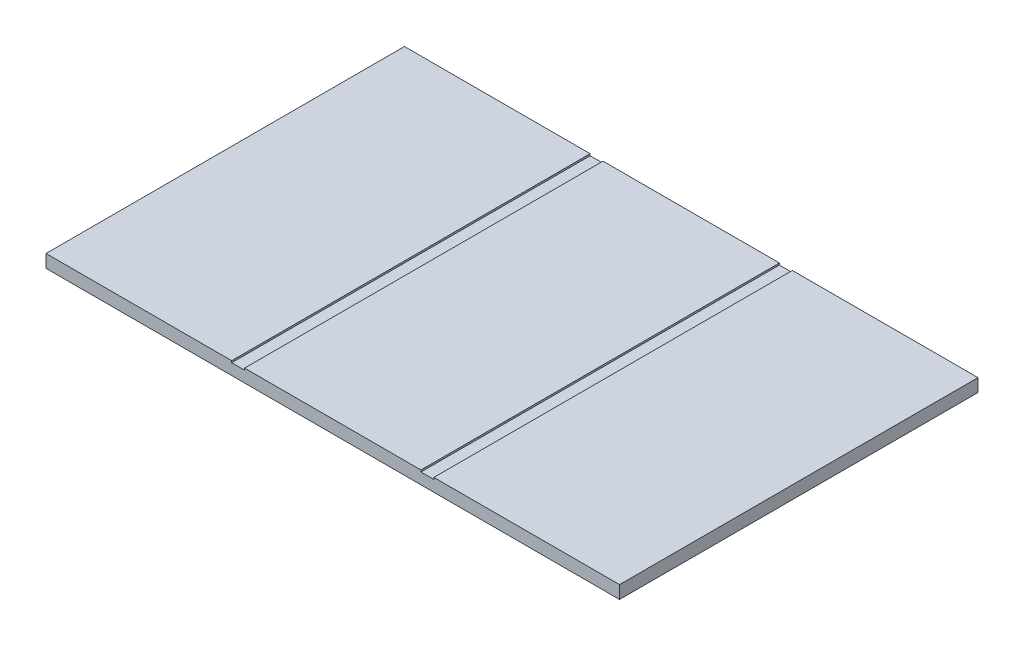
ISO-10303-21;
HEADER;
FILE_DESCRIPTION(('STEP AP214'),'2;1');
FILE_NAME('part.step','',(''),(''),'','','');
FILE_SCHEMA(('AUTOMOTIVE_DESIGN { 1 0 10303 214 1 1 1 1 }'));
ENDSEC;
DATA;
#1=APPLICATION_CONTEXT('core data for automotive mechanical design processes');
#2=APPLICATION_PROTOCOL_DEFINITION('international standard','automotive_design',2000,#1);
#3=PRODUCT_CONTEXT('',#1,'mechanical');
#4=PRODUCT('Part','Part','',(#3));
#5=PRODUCT_RELATED_PRODUCT_CATEGORY('part','',(#4));
#6=PRODUCT_DEFINITION_FORMATION('','',#4);
#7=PRODUCT_DEFINITION_CONTEXT('part definition',#1,'design');
#8=PRODUCT_DEFINITION('design','',#6,#7);
#9=PRODUCT_DEFINITION_SHAPE('','',#8);
#10=(LENGTH_UNIT() NAMED_UNIT(*) SI_UNIT(.MILLI.,.METRE.));
#11=(NAMED_UNIT(*) PLANE_ANGLE_UNIT() SI_UNIT($,.RADIAN.));
#12=(NAMED_UNIT(*) SI_UNIT($,.STERADIAN.) SOLID_ANGLE_UNIT());
#13=UNCERTAINTY_MEASURE_WITH_UNIT(LENGTH_MEASURE(1.E-05),#10,'distance_accuracy_value','');
#14=(GEOMETRIC_REPRESENTATION_CONTEXT(3) GLOBAL_UNCERTAINTY_ASSIGNED_CONTEXT((#13)) GLOBAL_UNIT_ASSIGNED_CONTEXT((#10,
#11,#12)) REPRESENTATION_CONTEXT('',''));
#15=CARTESIAN_POINT('',(0.,0.,0.));
#16=DIRECTION('',(0.,0.,1.));
#17=DIRECTION('',(1.,0.,0.));
#18=AXIS2_PLACEMENT_3D('',#15,#16,#17);
#19=CARTESIAN_POINT('',(0.,18.,0.));
#20=DIRECTION('',(0.,1.,0.));
#21=DIRECTION('',(0.,0.,1.));
#22=AXIS2_PLACEMENT_3D('',#19,#20,#21);
#23=PLANE('',#22);
#24=DIRECTION('',(0.,0.,1.));
#25=VECTOR('',#24,1.);
#26=CARTESIAN_POINT('',(122.999999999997,18.,-250.));
#27=LINE('',#26,#25);
#28=CARTESIAN_POINT('',(122.999999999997,18.,-250.));
#29=VERTEX_POINT('',#28);
#30=CARTESIAN_POINT('',(122.999999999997,18.,250.));
#31=VERTEX_POINT('',#30);
#32=EDGE_CURVE('E128',#29,#31,#27,.T.);
#33=ORIENTED_EDGE('',*,*,#32,.F.);
#34=DIRECTION('',(-1.,0.,0.));
#35=VECTOR('',#34,1.);
#36=CARTESIAN_POINT('',(-400.,18.,-250.));
#37=LINE('',#36,#35);
#38=CARTESIAN_POINT('',(-122.999999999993,18.,-250.));
#39=VERTEX_POINT('',#38);
#40=EDGE_CURVE('E201',#29,#39,#37,.T.);
#41=ORIENTED_EDGE('',*,*,#40,.T.);
#42=DIRECTION('',(0.,0.,-1.));
#43=VECTOR('',#42,1.);
#44=CARTESIAN_POINT('',(-122.999999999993,18.,-250.));
#45=LINE('',#44,#43);
#46=CARTESIAN_POINT('',(-122.999999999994,18.,250.));
#47=VERTEX_POINT('',#46);
#48=EDGE_CURVE('E164',#47,#39,#45,.T.);
#49=ORIENTED_EDGE('',*,*,#48,.F.);
#50=DIRECTION('',(1.,0.,0.));
#51=VECTOR('',#50,1.);
#52=CARTESIAN_POINT('',(-400.,18.,250.));
#53=LINE('',#52,#51);
#54=EDGE_CURVE('E194',#47,#31,#53,.T.);
#55=ORIENTED_EDGE('',*,*,#54,.T.);
#56=EDGE_LOOP('',(#33,#41,#49,#55));
#57=FACE_BOUND('',#56,.T.);
#58=ADVANCED_FACE('F33',(#57),#23,.T.);
#59=DIRECTION('',(0.,0.,1.));
#60=VECTOR('',#59,1.);
#61=CARTESIAN_POINT('',(-140.999999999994,18.,-250.));
#62=LINE('',#61,#60);
#63=CARTESIAN_POINT('',(-140.999999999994,18.,-250.));
#64=VERTEX_POINT('',#63);
#65=CARTESIAN_POINT('',(-140.999999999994,18.,250.));
#66=VERTEX_POINT('',#65);
#67=EDGE_CURVE('E155',#64,#66,#62,.T.);
#68=ORIENTED_EDGE('',*,*,#67,.F.);
#69=CARTESIAN_POINT('',(-400.,18.,-250.));
#70=VERTEX_POINT('',#69);
#71=EDGE_CURVE('E196',#64,#70,#37,.T.);
#72=ORIENTED_EDGE('',*,*,#71,.T.);
#73=DIRECTION('',(0.,0.,1.));
#74=VECTOR('',#73,1.);
#75=CARTESIAN_POINT('',(-400.,18.,-250.));
#76=LINE('',#75,#74);
#77=CARTESIAN_POINT('',(-400.,18.,250.));
#78=VERTEX_POINT('',#77);
#79=EDGE_CURVE('E185',#70,#78,#76,.T.);
#80=ORIENTED_EDGE('',*,*,#79,.T.);
#81=EDGE_CURVE('E190',#78,#66,#53,.T.);
#82=ORIENTED_EDGE('',*,*,#81,.T.);
#83=EDGE_LOOP('',(#68,#72,#80,#82));
#84=FACE_BOUND('',#83,.T.);
#85=ADVANCED_FACE('F235',(#84),#23,.T.);
#86=CARTESIAN_POINT('',(-400.,18.,-250.));
#87=DIRECTION('',(1.,0.,0.));
#88=DIRECTION('',(0.,0.,-1.));
#89=AXIS2_PLACEMENT_3D('',#86,#87,#88);
#90=PLANE('',#89);
#91=DIRECTION('',(0.,0.,1.));
#92=VECTOR('',#91,1.);
#93=CARTESIAN_POINT('',(-400.,0.,-250.));
#94=LINE('',#93,#92);
#95=CARTESIAN_POINT('',(-400.,0.,-250.));
#96=VERTEX_POINT('',#95);
#97=CARTESIAN_POINT('',(-400.,0.,250.));
#98=VERTEX_POINT('',#97);
#99=EDGE_CURVE('E178',#96,#98,#94,.T.);
#100=ORIENTED_EDGE('',*,*,#99,.T.);
#101=DIRECTION('',(0.,-1.,0.));
#102=VECTOR('',#101,1.);
#103=CARTESIAN_POINT('',(-400.,18.,250.));
#104=LINE('',#103,#102);
#105=EDGE_CURVE('E11',#78,#98,#104,.T.);
#106=ORIENTED_EDGE('',*,*,#105,.F.);
#107=ORIENTED_EDGE('',*,*,#79,.F.);
#108=DIRECTION('',(0.,-1.,0.));
#109=VECTOR('',#108,1.);
#110=CARTESIAN_POINT('',(-400.,18.,-250.));
#111=LINE('',#110,#109);
#112=EDGE_CURVE('E200',#70,#96,#111,.T.);
#113=ORIENTED_EDGE('',*,*,#112,.T.);
#114=EDGE_LOOP('',(#100,#106,#107,#113));
#115=FACE_BOUND('',#114,.T.);
#116=ADVANCED_FACE('F35',(#115),#90,.F.);
#117=CARTESIAN_POINT('',(-400.,18.,250.));
#118=DIRECTION('',(0.,0.,-1.));
#119=DIRECTION('',(-1.,0.,0.));
#120=AXIS2_PLACEMENT_3D('',#117,#118,#119);
#121=PLANE('',#120);
#122=DIRECTION('',(1.,0.,0.));
#123=VECTOR('',#122,1.);
#124=CARTESIAN_POINT('',(122.999999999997,15.5,250.));
#125=LINE('',#124,#123);
#126=CARTESIAN_POINT('',(122.999999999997,15.5,250.));
#127=VERTEX_POINT('',#126);
#128=CARTESIAN_POINT('',(140.999999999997,15.5,250.));
#129=VERTEX_POINT('',#128);
#130=EDGE_CURVE('E139',#127,#129,#125,.T.);
#131=ORIENTED_EDGE('',*,*,#130,.F.);
#132=DIRECTION('',(0.,1.,0.));
#133=VECTOR('',#132,1.);
#134=CARTESIAN_POINT('',(122.999999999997,15.5,250.));
#135=LINE('',#134,#133);
#136=EDGE_CURVE('E122',#127,#31,#135,.T.);
#137=ORIENTED_EDGE('',*,*,#136,.T.);
#138=ORIENTED_EDGE('',*,*,#54,.F.);
#139=DIRECTION('',(0.,1.,0.));
#140=VECTOR('',#139,1.);
#141=CARTESIAN_POINT('',(-122.999999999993,15.5,250.));
#142=LINE('',#141,#140);
#143=CARTESIAN_POINT('',(-122.999999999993,15.5,250.));
#144=VERTEX_POINT('',#143);
#145=EDGE_CURVE('E56',#144,#47,#142,.T.);
#146=ORIENTED_EDGE('',*,*,#145,.F.);
#147=DIRECTION('',(1.,0.,0.));
#148=VECTOR('',#147,1.);
#149=CARTESIAN_POINT('',(-140.999999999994,15.5,250.));
#150=LINE('',#149,#148);
#151=CARTESIAN_POINT('',(-140.999999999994,15.5,250.));
#152=VERTEX_POINT('',#151);
#153=EDGE_CURVE('E163',#152,#144,#150,.T.);
#154=ORIENTED_EDGE('',*,*,#153,.F.);
#155=DIRECTION('',(0.,1.,0.));
#156=VECTOR('',#155,1.);
#157=CARTESIAN_POINT('',(-140.999999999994,15.5,250.));
#158=LINE('',#157,#156);
#159=EDGE_CURVE('E173',#152,#66,#158,.T.);
#160=ORIENTED_EDGE('',*,*,#159,.T.);
#161=ORIENTED_EDGE('',*,*,#81,.F.);
#162=ORIENTED_EDGE('',*,*,#105,.T.);
#163=DIRECTION('',(1.,0.,0.));
#164=VECTOR('',#163,1.);
#165=CARTESIAN_POINT('',(-400.,0.,250.));
#166=LINE('',#165,#164);
#167=CARTESIAN_POINT('',(400.,0.,250.));
#168=VERTEX_POINT('',#167);
#169=EDGE_CURVE('E204',#98,#168,#166,.T.);
#170=ORIENTED_EDGE('',*,*,#169,.T.);
#171=DIRECTION('',(0.,-1.,0.));
#172=VECTOR('',#171,1.);
#173=CARTESIAN_POINT('',(400.,18.,250.));
#174=LINE('',#173,#172);
#175=CARTESIAN_POINT('',(400.,18.,250.));
#176=VERTEX_POINT('',#175);
#177=EDGE_CURVE('E41',#176,#168,#174,.T.);
#178=ORIENTED_EDGE('',*,*,#177,.F.);
#179=CARTESIAN_POINT('',(140.999999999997,18.,250.));
#180=VERTEX_POINT('',#179);
#181=EDGE_CURVE('E188',#180,#176,#53,.T.);
#182=ORIENTED_EDGE('',*,*,#181,.F.);
#183=DIRECTION('',(0.,1.,0.));
#184=VECTOR('',#183,1.);
#185=CARTESIAN_POINT('',(140.999999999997,15.5,250.));
#186=LINE('',#185,#184);
#187=EDGE_CURVE('E48',#129,#180,#186,.T.);
#188=ORIENTED_EDGE('',*,*,#187,.F.);
#189=EDGE_LOOP('',(#131,#137,#138,#146,#154,#160,#161,#162,#170,#178,#182,#188));
#190=FACE_BOUND('',#189,.T.);
#191=ADVANCED_FACE('F144',(#190),#121,.F.);
#192=CARTESIAN_POINT('',(400.,18.,-250.));
#193=DIRECTION('',(-1.,0.,0.));
#194=DIRECTION('',(0.,0.,1.));
#195=AXIS2_PLACEMENT_3D('',#192,#193,#194);
#196=PLANE('',#195);
#197=DIRECTION('',(0.,0.,-1.));
#198=VECTOR('',#197,1.);
#199=CARTESIAN_POINT('',(400.,0.,-250.));
#200=LINE('',#199,#198);
#201=CARTESIAN_POINT('',(400.,0.,-250.));
#202=VERTEX_POINT('',#201);
#203=EDGE_CURVE('E206',#168,#202,#200,.T.);
#204=ORIENTED_EDGE('',*,*,#203,.T.);
#205=DIRECTION('',(0.,-1.,0.));
#206=VECTOR('',#205,1.);
#207=CARTESIAN_POINT('',(400.,18.,-250.));
#208=LINE('',#207,#206);
#209=CARTESIAN_POINT('',(400.,18.,-250.));
#210=VERTEX_POINT('',#209);
#211=EDGE_CURVE('E211',#210,#202,#208,.T.);
#212=ORIENTED_EDGE('',*,*,#211,.F.);
#213=DIRECTION('',(0.,0.,-1.));
#214=VECTOR('',#213,1.);
#215=CARTESIAN_POINT('',(400.,18.,-250.));
#216=LINE('',#215,#214);
#217=EDGE_CURVE('E193',#176,#210,#216,.T.);
#218=ORIENTED_EDGE('',*,*,#217,.F.);
#219=ORIENTED_EDGE('',*,*,#177,.T.);
#220=EDGE_LOOP('',(#204,#212,#218,#219));
#221=FACE_BOUND('',#220,.T.);
#222=ADVANCED_FACE('F218',(#221),#196,.F.);
#223=CARTESIAN_POINT('',(-400.,18.,-250.));
#224=DIRECTION('',(0.,0.,1.));
#225=DIRECTION('',(1.,0.,0.));
#226=AXIS2_PLACEMENT_3D('',#223,#224,#225);
#227=PLANE('',#226);
#228=ORIENTED_EDGE('',*,*,#40,.F.);
#229=DIRECTION('',(0.,1.,0.));
#230=VECTOR('',#229,1.);
#231=CARTESIAN_POINT('',(122.999999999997,15.5,-250.));
#232=LINE('',#231,#230);
#233=CARTESIAN_POINT('',(122.999999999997,15.5,-250.));
#234=VERTEX_POINT('',#233);
#235=EDGE_CURVE('E153',#234,#29,#232,.T.);
#236=ORIENTED_EDGE('',*,*,#235,.F.);
#237=DIRECTION('',(-1.,0.,0.));
#238=VECTOR('',#237,1.);
#239=CARTESIAN_POINT('',(122.999999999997,15.5,-250.));
#240=LINE('',#239,#238);
#241=CARTESIAN_POINT('',(140.999999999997,15.5,-250.));
#242=VERTEX_POINT('',#241);
#243=EDGE_CURVE('E133',#242,#234,#240,.T.);
#244=ORIENTED_EDGE('',*,*,#243,.F.);
#245=DIRECTION('',(0.,1.,0.));
#246=VECTOR('',#245,1.);
#247=CARTESIAN_POINT('',(140.999999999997,15.5,-250.));
#248=LINE('',#247,#246);
#249=CARTESIAN_POINT('',(140.999999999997,18.,-250.));
#250=VERTEX_POINT('',#249);
#251=EDGE_CURVE('E156',#242,#250,#248,.T.);
#252=ORIENTED_EDGE('',*,*,#251,.T.);
#253=EDGE_CURVE('E197',#210,#250,#37,.T.);
#254=ORIENTED_EDGE('',*,*,#253,.F.);
#255=ORIENTED_EDGE('',*,*,#211,.T.);
#256=DIRECTION('',(-1.,0.,0.));
#257=VECTOR('',#256,1.);
#258=CARTESIAN_POINT('',(-400.,0.,-250.));
#259=LINE('',#258,#257);
#260=EDGE_CURVE('E189',#202,#96,#259,.T.);
#261=ORIENTED_EDGE('',*,*,#260,.T.);
#262=ORIENTED_EDGE('',*,*,#112,.F.);
#263=ORIENTED_EDGE('',*,*,#71,.F.);
#264=DIRECTION('',(0.,1.,0.));
#265=VECTOR('',#264,1.);
#266=CARTESIAN_POINT('',(-140.999999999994,15.5,-250.));
#267=LINE('',#266,#265);
#268=CARTESIAN_POINT('',(-140.999999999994,15.5,-250.));
#269=VERTEX_POINT('',#268);
#270=EDGE_CURVE('E176',#269,#64,#267,.T.);
#271=ORIENTED_EDGE('',*,*,#270,.F.);
#272=DIRECTION('',(-1.,0.,0.));
#273=VECTOR('',#272,1.);
#274=CARTESIAN_POINT('',(-140.999999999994,15.5,-250.));
#275=LINE('',#274,#273);
#276=CARTESIAN_POINT('',(-122.999999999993,15.5,-250.));
#277=VERTEX_POINT('',#276);
#278=EDGE_CURVE('E170',#277,#269,#275,.T.);
#279=ORIENTED_EDGE('',*,*,#278,.F.);
#280=DIRECTION('',(0.,1.,0.));
#281=VECTOR('',#280,1.);
#282=CARTESIAN_POINT('',(-122.999999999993,15.5,-250.));
#283=LINE('',#282,#281);
#284=EDGE_CURVE('E179',#277,#39,#283,.T.);
#285=ORIENTED_EDGE('',*,*,#284,.T.);
#286=EDGE_LOOP('',(#228,#236,#244,#252,#254,#255,#261,#262,#263,#271,#279,#285));
#287=FACE_BOUND('',#286,.T.);
#288=ADVANCED_FACE('F227',(#287),#227,.F.);
#289=DIRECTION('',(0.,0.,-1.));
#290=VECTOR('',#289,1.);
#291=CARTESIAN_POINT('',(140.999999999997,18.,-250.));
#292=LINE('',#291,#290);
#293=EDGE_CURVE('E142',#180,#250,#292,.T.);
#294=ORIENTED_EDGE('',*,*,#293,.F.);
#295=ORIENTED_EDGE('',*,*,#181,.T.);
#296=ORIENTED_EDGE('',*,*,#217,.T.);
#297=ORIENTED_EDGE('',*,*,#253,.T.);
#298=EDGE_LOOP('',(#294,#295,#296,#297));
#299=FACE_BOUND('',#298,.T.);
#300=ADVANCED_FACE('F244',(#299),#23,.T.);
#301=CARTESIAN_POINT('',(0.,0.,0.));
#302=DIRECTION('',(0.,1.,0.));
#303=DIRECTION('',(0.,0.,1.));
#304=AXIS2_PLACEMENT_3D('',#301,#302,#303);
#305=PLANE('',#304);
#306=ORIENTED_EDGE('',*,*,#99,.F.);
#307=ORIENTED_EDGE('',*,*,#260,.F.);
#308=ORIENTED_EDGE('',*,*,#203,.F.);
#309=ORIENTED_EDGE('',*,*,#169,.F.);
#310=EDGE_LOOP('',(#306,#307,#308,#309));
#311=FACE_BOUND('',#310,.T.);
#312=ADVANCED_FACE('F223',(#311),#305,.F.);
#313=CARTESIAN_POINT('',(-140.999999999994,15.5,-250.));
#314=DIRECTION('',(-1.,0.,0.));
#315=DIRECTION('',(0.,0.,1.));
#316=AXIS2_PLACEMENT_3D('',#313,#314,#315);
#317=PLANE('',#316);
#318=ORIENTED_EDGE('',*,*,#67,.T.);
#319=ORIENTED_EDGE('',*,*,#159,.F.);
#320=DIRECTION('',(0.,0.,1.));
#321=VECTOR('',#320,1.);
#322=CARTESIAN_POINT('',(-140.999999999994,15.5,-250.));
#323=LINE('',#322,#321);
#324=EDGE_CURVE('E160',#269,#152,#323,.T.);
#325=ORIENTED_EDGE('',*,*,#324,.F.);
#326=ORIENTED_EDGE('',*,*,#270,.T.);
#327=EDGE_LOOP('',(#318,#319,#325,#326));
#328=FACE_BOUND('',#327,.T.);
#329=ADVANCED_FACE('F268',(#328),#317,.F.);
#330=CARTESIAN_POINT('',(-122.999999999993,15.5,-250.));
#331=DIRECTION('',(1.,0.,0.));
#332=DIRECTION('',(0.,0.,-1.));
#333=AXIS2_PLACEMENT_3D('',#330,#331,#332);
#334=PLANE('',#333);
#335=ORIENTED_EDGE('',*,*,#48,.T.);
#336=ORIENTED_EDGE('',*,*,#284,.F.);
#337=DIRECTION('',(0.,0.,-1.));
#338=VECTOR('',#337,1.);
#339=CARTESIAN_POINT('',(-122.999999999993,15.5,-250.));
#340=LINE('',#339,#338);
#341=EDGE_CURVE('E167',#144,#277,#340,.T.);
#342=ORIENTED_EDGE('',*,*,#341,.F.);
#343=ORIENTED_EDGE('',*,*,#145,.T.);
#344=EDGE_LOOP('',(#335,#336,#342,#343));
#345=FACE_BOUND('',#344,.T.);
#346=ADVANCED_FACE('F238',(#345),#334,.F.);
#347=CARTESIAN_POINT('',(0.,15.5,0.));
#348=DIRECTION('',(0.,1.,0.));
#349=DIRECTION('',(0.,0.,1.));
#350=AXIS2_PLACEMENT_3D('',#347,#348,#349);
#351=PLANE('',#350);
#352=ORIENTED_EDGE('',*,*,#324,.T.);
#353=ORIENTED_EDGE('',*,*,#153,.T.);
#354=ORIENTED_EDGE('',*,*,#341,.T.);
#355=ORIENTED_EDGE('',*,*,#278,.T.);
#356=EDGE_LOOP('',(#352,#353,#354,#355));
#357=FACE_BOUND('',#356,.T.);
#358=ADVANCED_FACE('F241',(#357),#351,.T.);
#359=CARTESIAN_POINT('',(122.999999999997,15.5,-250.));
#360=DIRECTION('',(-1.,0.,0.));
#361=DIRECTION('',(0.,0.,1.));
#362=AXIS2_PLACEMENT_3D('',#359,#360,#361);
#363=PLANE('',#362);
#364=ORIENTED_EDGE('',*,*,#32,.T.);
#365=ORIENTED_EDGE('',*,*,#136,.F.);
#366=DIRECTION('',(0.,0.,1.));
#367=VECTOR('',#366,1.);
#368=CARTESIAN_POINT('',(122.999999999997,15.5,-250.));
#369=LINE('',#368,#367);
#370=EDGE_CURVE('E125',#234,#127,#369,.T.);
#371=ORIENTED_EDGE('',*,*,#370,.F.);
#372=ORIENTED_EDGE('',*,*,#235,.T.);
#373=EDGE_LOOP('',(#364,#365,#371,#372));
#374=FACE_BOUND('',#373,.T.);
#375=ADVANCED_FACE('F124',(#374),#363,.F.);
#376=CARTESIAN_POINT('',(140.999999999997,15.5,-250.));
#377=DIRECTION('',(1.,0.,0.));
#378=DIRECTION('',(0.,0.,-1.));
#379=AXIS2_PLACEMENT_3D('',#376,#377,#378);
#380=PLANE('',#379);
#381=ORIENTED_EDGE('',*,*,#293,.T.);
#382=ORIENTED_EDGE('',*,*,#251,.F.);
#383=DIRECTION('',(0.,0.,-1.));
#384=VECTOR('',#383,1.);
#385=CARTESIAN_POINT('',(140.999999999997,15.5,-250.));
#386=LINE('',#385,#384);
#387=EDGE_CURVE('E146',#129,#242,#386,.T.);
#388=ORIENTED_EDGE('',*,*,#387,.F.);
#389=ORIENTED_EDGE('',*,*,#187,.T.);
#390=EDGE_LOOP('',(#381,#382,#388,#389));
#391=FACE_BOUND('',#390,.T.);
#392=ADVANCED_FACE('F245',(#391),#380,.F.);
#393=CARTESIAN_POINT('',(0.,15.5,0.));
#394=DIRECTION('',(0.,1.,0.));
#395=DIRECTION('',(0.,0.,1.));
#396=AXIS2_PLACEMENT_3D('',#393,#394,#395);
#397=PLANE('',#396);
#398=ORIENTED_EDGE('',*,*,#370,.T.);
#399=ORIENTED_EDGE('',*,*,#130,.T.);
#400=ORIENTED_EDGE('',*,*,#387,.T.);
#401=ORIENTED_EDGE('',*,*,#243,.T.);
#402=EDGE_LOOP('',(#398,#399,#400,#401));
#403=FACE_BOUND('',#402,.T.);
#404=ADVANCED_FACE('F137',(#403),#397,.T.);
#405=CLOSED_SHELL('',(#58,#85,#116,#191,#222,#288,#300,#312,#329,#346,#358,#375,#392,#404));
#406=MANIFOLD_SOLID_BREP('B2',#405);
#407=ADVANCED_BREP_SHAPE_REPRESENTATION('',(#18,#406),#14);
#408=SHAPE_DEFINITION_REPRESENTATION(#9,#407);
ENDSEC;
END-ISO-10303-21;
